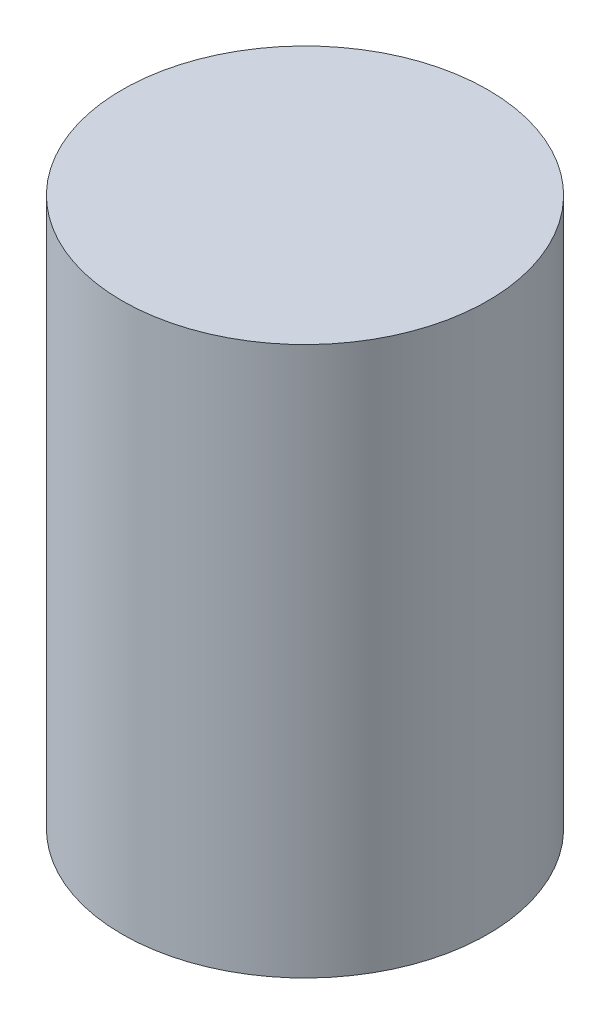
ISO-10303-21;
HEADER;
FILE_DESCRIPTION(('STEP AP214'),'2;1');
FILE_NAME('part.step','',(''),(''),'','','');
FILE_SCHEMA(('AUTOMOTIVE_DESIGN { 1 0 10303 214 1 1 1 1 }'));
ENDSEC;
DATA;
#1=APPLICATION_CONTEXT('core data for automotive mechanical design processes');
#2=APPLICATION_PROTOCOL_DEFINITION('international standard','automotive_design',2000,#1);
#3=PRODUCT_CONTEXT('',#1,'mechanical');
#4=PRODUCT('Part','Part','',(#3));
#5=PRODUCT_RELATED_PRODUCT_CATEGORY('part','',(#4));
#6=PRODUCT_DEFINITION_FORMATION('','',#4);
#7=PRODUCT_DEFINITION_CONTEXT('part definition',#1,'design');
#8=PRODUCT_DEFINITION('design','',#6,#7);
#9=PRODUCT_DEFINITION_SHAPE('','',#8);
#10=(LENGTH_UNIT() NAMED_UNIT(*) SI_UNIT(.MILLI.,.METRE.));
#11=(NAMED_UNIT(*) PLANE_ANGLE_UNIT() SI_UNIT($,.RADIAN.));
#12=(NAMED_UNIT(*) SI_UNIT($,.STERADIAN.) SOLID_ANGLE_UNIT());
#13=UNCERTAINTY_MEASURE_WITH_UNIT(LENGTH_MEASURE(1.E-05),#10,'distance_accuracy_value','');
#14=(GEOMETRIC_REPRESENTATION_CONTEXT(3) GLOBAL_UNCERTAINTY_ASSIGNED_CONTEXT((#13)) GLOBAL_UNIT_ASSIGNED_CONTEXT((#10,
#11,#12)) REPRESENTATION_CONTEXT('',''));
#15=CARTESIAN_POINT('',(0.,0.,0.));
#16=DIRECTION('',(0.,0.,1.));
#17=DIRECTION('',(1.,0.,0.));
#18=AXIS2_PLACEMENT_3D('',#15,#16,#17);
#19=CARTESIAN_POINT('',(0.,60.,0.));
#20=DIRECTION('',(0.,1.,0.));
#21=DIRECTION('',(0.,0.,1.));
#22=AXIS2_PLACEMENT_3D('',#19,#20,#21);
#23=PLANE('',#22);
#24=CARTESIAN_POINT('',(0.,60.,0.));
#25=DIRECTION('',(0.,1.,0.));
#26=DIRECTION('',(0.,0.,1.));
#27=AXIS2_PLACEMENT_3D('',#24,#25,#26);
#28=CIRCLE('',#27,20.);
#29=CARTESIAN_POINT('',(0.,60.,20.));
#30=VERTEX_POINT('',#29);
#31=EDGE_CURVE('E10',#30,#30,#28,.T.);
#32=ORIENTED_EDGE('',*,*,#31,.T.);
#33=EDGE_LOOP('',(#32));
#34=FACE_BOUND('',#33,.T.);
#35=ADVANCED_FACE('F29',(#34),#23,.T.);
#36=CARTESIAN_POINT('',(0.,100.479411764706,0.));
#37=DIRECTION('',(0.,1.,0.));
#38=DIRECTION('',(0.,0.,1.));
#39=AXIS2_PLACEMENT_3D('',#36,#37,#38);
#40=CYLINDRICAL_SURFACE('',#39,20.);
#41=CARTESIAN_POINT('',(0.,0.,0.));
#42=DIRECTION('',(0.,1.,0.));
#43=DIRECTION('',(0.,0.,1.));
#44=AXIS2_PLACEMENT_3D('',#41,#42,#43);
#45=CIRCLE('',#44,20.);
#46=CARTESIAN_POINT('',(0.,0.,20.));
#47=VERTEX_POINT('',#46);
#48=EDGE_CURVE('E35',#47,#47,#45,.T.);
#49=ORIENTED_EDGE('',*,*,#48,.T.);
#50=EDGE_LOOP('',(#49));
#51=FACE_BOUND('',#50,.T.);
#52=ORIENTED_EDGE('',*,*,#31,.F.);
#53=EDGE_LOOP('',(#52));
#54=FACE_BOUND('',#53,.T.);
#55=ADVANCED_FACE('F41',(#51,#54),#40,.T.);
#56=CARTESIAN_POINT('',(-20.,0.,0.));
#57=DIRECTION('',(0.,-1.,0.));
#58=DIRECTION('',(0.,0.,-1.));
#59=AXIS2_PLACEMENT_3D('',#56,#57,#58);
#60=PLANE('',#59);
#61=ORIENTED_EDGE('',*,*,#48,.F.);
#62=EDGE_LOOP('',(#61));
#63=FACE_BOUND('',#62,.T.);
#64=ADVANCED_FACE('F44',(#63),#60,.T.);
#65=CLOSED_SHELL('',(#35,#55,#64));
#66=MANIFOLD_SOLID_BREP('B2',#65);
#67=ADVANCED_BREP_SHAPE_REPRESENTATION('',(#18,#66),#14);
#68=SHAPE_DEFINITION_REPRESENTATION(#9,#67);
ENDSEC;
END-ISO-10303-21;
